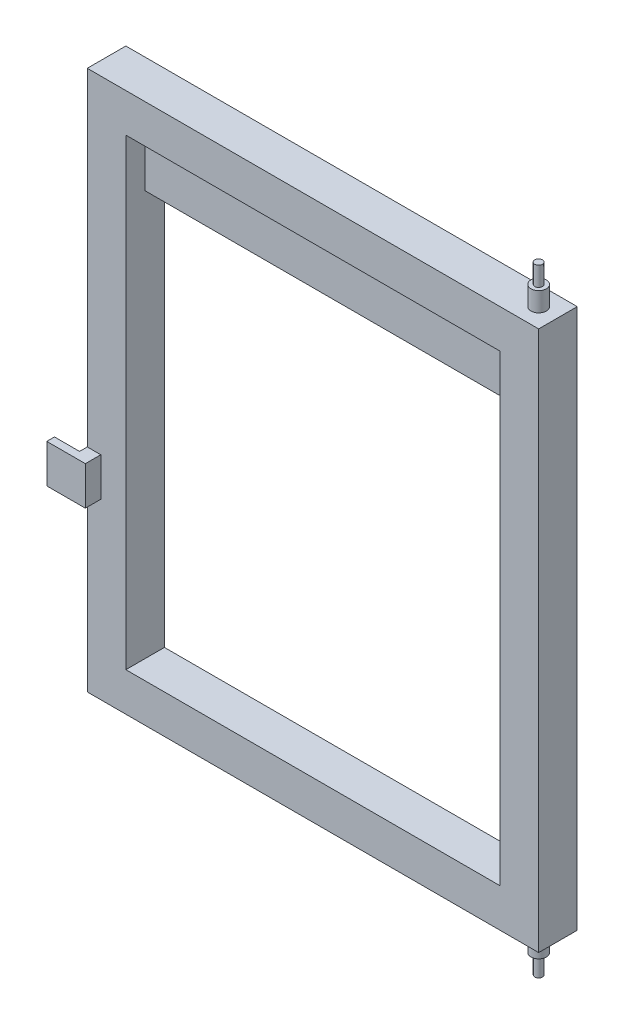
ISO-10303-21;
HEADER;
FILE_DESCRIPTION(('STEP AP214'),'2;1');
FILE_NAME('part.step','',(''),(''),'','','');
FILE_SCHEMA(('AUTOMOTIVE_DESIGN { 1 0 10303 214 1 1 1 1 }'));
ENDSEC;
DATA;
#1=APPLICATION_CONTEXT('core data for automotive mechanical design processes');
#2=APPLICATION_PROTOCOL_DEFINITION('international standard','automotive_design',2000,#1);
#3=PRODUCT_CONTEXT('',#1,'mechanical');
#4=PRODUCT('Part','Part','',(#3));
#5=PRODUCT_RELATED_PRODUCT_CATEGORY('part','',(#4));
#6=PRODUCT_DEFINITION_FORMATION('','',#4);
#7=PRODUCT_DEFINITION_CONTEXT('part definition',#1,'design');
#8=PRODUCT_DEFINITION('design','',#6,#7);
#9=PRODUCT_DEFINITION_SHAPE('','',#8);
#10=(LENGTH_UNIT() NAMED_UNIT(*) SI_UNIT(.MILLI.,.METRE.));
#11=(NAMED_UNIT(*) PLANE_ANGLE_UNIT() SI_UNIT($,.RADIAN.));
#12=(NAMED_UNIT(*) SI_UNIT($,.STERADIAN.) SOLID_ANGLE_UNIT());
#13=UNCERTAINTY_MEASURE_WITH_UNIT(LENGTH_MEASURE(1.E-05),#10,'distance_accuracy_value','');
#14=(GEOMETRIC_REPRESENTATION_CONTEXT(3) GLOBAL_UNCERTAINTY_ASSIGNED_CONTEXT((#13)) GLOBAL_UNIT_ASSIGNED_CONTEXT((#10,
#11,#12)) REPRESENTATION_CONTEXT('',''));
#15=CARTESIAN_POINT('',(0.,0.,0.));
#16=DIRECTION('',(0.,0.,1.));
#17=DIRECTION('',(1.,0.,0.));
#18=AXIS2_PLACEMENT_3D('',#15,#16,#17);
#19=CARTESIAN_POINT('',(292.5,-350.,25.));
#20=DIRECTION('',(0.,1.,0.));
#21=DIRECTION('',(-1.,0.,0.));
#22=AXIS2_PLACEMENT_3D('',#19,#20,#21);
#23=PLANE('',#22);
#24=DIRECTION('',(1.,0.,0.));
#25=VECTOR('',#24,1.);
#26=CARTESIAN_POINT('',(292.5,-350.,-25.));
#27=LINE('',#26,#25);
#28=CARTESIAN_POINT('',(-292.5,-350.,-25.));
#29=VERTEX_POINT('',#28);
#30=CARTESIAN_POINT('',(292.5,-350.,-25.));
#31=VERTEX_POINT('',#30);
#32=EDGE_CURVE('E249',#29,#31,#27,.T.);
#33=ORIENTED_EDGE('',*,*,#32,.T.);
#34=DIRECTION('',(0.,0.,-1.));
#35=VECTOR('',#34,1.);
#36=CARTESIAN_POINT('',(292.5,-350.,25.));
#37=LINE('',#36,#35);
#38=CARTESIAN_POINT('',(292.5,-350.,25.));
#39=VERTEX_POINT('',#38);
#40=EDGE_CURVE('E201',#39,#31,#37,.T.);
#41=ORIENTED_EDGE('',*,*,#40,.F.);
#42=DIRECTION('',(1.,0.,0.));
#43=VECTOR('',#42,1.);
#44=CARTESIAN_POINT('',(292.5,-350.,25.));
#45=LINE('',#44,#43);
#46=CARTESIAN_POINT('',(-292.5,-350.,25.));
#47=VERTEX_POINT('',#46);
#48=EDGE_CURVE('E216',#47,#39,#45,.T.);
#49=ORIENTED_EDGE('',*,*,#48,.F.);
#50=DIRECTION('',(0.,0.,-1.));
#51=VECTOR('',#50,1.);
#52=CARTESIAN_POINT('',(-292.5,-350.,25.));
#53=LINE('',#52,#51);
#54=EDGE_CURVE('E196',#47,#29,#53,.T.);
#55=ORIENTED_EDGE('',*,*,#54,.T.);
#56=EDGE_LOOP('',(#33,#41,#49,#55));
#57=FACE_BOUND('',#56,.T.);
#58=CARTESIAN_POINT('',(267.5,-350.,0.));
#59=DIRECTION('',(0.,1.,0.));
#60=DIRECTION('',(-1.,0.,0.));
#61=AXIS2_PLACEMENT_3D('',#58,#59,#60);
#62=CIRCLE('',#61,10.);
#63=CARTESIAN_POINT('',(257.5,-350.,0.));
#64=VERTEX_POINT('',#63);
#65=EDGE_CURVE('E11',#64,#64,#62,.F.);
#66=ORIENTED_EDGE('',*,*,#65,.F.);
#67=EDGE_LOOP('',(#66));
#68=FACE_BOUND('',#67,.T.);
#69=ADVANCED_FACE('F39',(#57,#68),#23,.F.);
#70=CARTESIAN_POINT('',(292.5,350.,25.));
#71=DIRECTION('',(0.,-1.,0.));
#72=DIRECTION('',(1.,0.,0.));
#73=AXIS2_PLACEMENT_3D('',#70,#71,#72);
#74=PLANE('',#73);
#75=DIRECTION('',(-1.,0.,0.));
#76=VECTOR('',#75,1.);
#77=CARTESIAN_POINT('',(292.5,350.,-25.));
#78=LINE('',#77,#76);
#79=CARTESIAN_POINT('',(292.5,350.,-25.));
#80=VERTEX_POINT('',#79);
#81=CARTESIAN_POINT('',(-292.5,350.,-25.));
#82=VERTEX_POINT('',#81);
#83=EDGE_CURVE('E222',#80,#82,#78,.T.);
#84=ORIENTED_EDGE('',*,*,#83,.T.);
#85=DIRECTION('',(0.,0.,-1.));
#86=VECTOR('',#85,1.);
#87=CARTESIAN_POINT('',(-292.5,350.,25.));
#88=LINE('',#87,#86);
#89=CARTESIAN_POINT('',(-292.5,350.,25.));
#90=VERTEX_POINT('',#89);
#91=EDGE_CURVE('E230',#90,#82,#88,.T.);
#92=ORIENTED_EDGE('',*,*,#91,.F.);
#93=DIRECTION('',(-1.,0.,0.));
#94=VECTOR('',#93,1.);
#95=CARTESIAN_POINT('',(292.5,350.,25.));
#96=LINE('',#95,#94);
#97=CARTESIAN_POINT('',(292.5,350.,25.));
#98=VERTEX_POINT('',#97);
#99=EDGE_CURVE('E228',#98,#90,#96,.T.);
#100=ORIENTED_EDGE('',*,*,#99,.F.);
#101=DIRECTION('',(0.,0.,-1.));
#102=VECTOR('',#101,1.);
#103=CARTESIAN_POINT('',(292.5,350.,25.));
#104=LINE('',#103,#102);
#105=EDGE_CURVE('E208',#98,#80,#104,.T.);
#106=ORIENTED_EDGE('',*,*,#105,.T.);
#107=EDGE_LOOP('',(#84,#92,#100,#106));
#108=FACE_BOUND('',#107,.T.);
#109=CARTESIAN_POINT('',(267.5,350.,0.));
#110=DIRECTION('',(0.,-1.,0.));
#111=DIRECTION('',(1.,0.,0.));
#112=AXIS2_PLACEMENT_3D('',#109,#110,#111);
#113=CIRCLE('',#112,10.);
#114=CARTESIAN_POINT('',(277.5,350.,0.));
#115=VERTEX_POINT('',#114);
#116=EDGE_CURVE('E43',#115,#115,#113,.F.);
#117=ORIENTED_EDGE('',*,*,#116,.F.);
#118=EDGE_LOOP('',(#117));
#119=FACE_BOUND('',#118,.T.);
#120=ADVANCED_FACE('F237',(#108,#119),#74,.F.);
#121=CARTESIAN_POINT('',(-292.5,350.,25.));
#122=DIRECTION('',(0.,0.,-1.));
#123=DIRECTION('',(-1.,0.,0.));
#124=AXIS2_PLACEMENT_3D('',#121,#122,#123);
#125=PLANE('',#124);
#126=DIRECTION('',(0.,1.,0.));
#127=VECTOR('',#126,1.);
#128=CARTESIAN_POINT('',(242.5,300.,25.));
#129=LINE('',#128,#127);
#130=CARTESIAN_POINT('',(242.5,-300.,25.));
#131=VERTEX_POINT('',#130);
#132=CARTESIAN_POINT('',(242.5,300.,25.));
#133=VERTEX_POINT('',#132);
#134=EDGE_CURVE('E271',#131,#133,#129,.T.);
#135=ORIENTED_EDGE('',*,*,#134,.F.);
#136=DIRECTION('',(1.,0.,0.));
#137=VECTOR('',#136,1.);
#138=CARTESIAN_POINT('',(242.5,-300.,25.));
#139=LINE('',#138,#137);
#140=CARTESIAN_POINT('',(-242.5,-300.,25.));
#141=VERTEX_POINT('',#140);
#142=EDGE_CURVE('E264',#141,#131,#139,.T.);
#143=ORIENTED_EDGE('',*,*,#142,.F.);
#144=DIRECTION('',(0.,-1.,0.));
#145=VECTOR('',#144,1.);
#146=CARTESIAN_POINT('',(-242.5,300.,25.));
#147=LINE('',#146,#145);
#148=CARTESIAN_POINT('',(-242.5,300.,25.));
#149=VERTEX_POINT('',#148);
#150=EDGE_CURVE('E266',#149,#141,#147,.T.);
#151=ORIENTED_EDGE('',*,*,#150,.F.);
#152=DIRECTION('',(-1.,0.,0.));
#153=VECTOR('',#152,1.);
#154=CARTESIAN_POINT('',(242.5,300.,25.));
#155=LINE('',#154,#153);
#156=EDGE_CURVE('E269',#133,#149,#155,.T.);
#157=ORIENTED_EDGE('',*,*,#156,.F.);
#158=EDGE_LOOP('',(#135,#143,#151,#157));
#159=FACE_BOUND('',#158,.T.);
#160=DIRECTION('',(1.,0.,0.));
#161=VECTOR('',#160,1.);
#162=CARTESIAN_POINT('',(-292.5,-125.,24.9999999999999));
#163=LINE('',#162,#161);
#164=CARTESIAN_POINT('',(-292.5,-125.,24.9999999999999));
#165=VERTEX_POINT('',#164);
#166=CARTESIAN_POINT('',(-275.,-125.,25.));
#167=VERTEX_POINT('',#166);
#168=EDGE_CURVE('E55',#165,#167,#163,.T.);
#169=ORIENTED_EDGE('',*,*,#168,.F.);
#170=DIRECTION('',(0.,-1.,0.));
#171=VECTOR('',#170,1.);
#172=CARTESIAN_POINT('',(-292.5,350.,25.));
#173=LINE('',#172,#171);
#174=EDGE_CURVE('E217',#165,#47,#173,.T.);
#175=ORIENTED_EDGE('',*,*,#174,.T.);
#176=ORIENTED_EDGE('',*,*,#48,.T.);
#177=DIRECTION('',(0.,1.,0.));
#178=VECTOR('',#177,1.);
#179=CARTESIAN_POINT('',(292.5,350.,25.));
#180=LINE('',#179,#178);
#181=EDGE_CURVE('E226',#39,#98,#180,.T.);
#182=ORIENTED_EDGE('',*,*,#181,.T.);
#183=ORIENTED_EDGE('',*,*,#99,.T.);
#184=CARTESIAN_POINT('',(-292.5,-75.,24.9999999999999));
#185=VERTEX_POINT('',#184);
#186=EDGE_CURVE('E212',#90,#185,#173,.T.);
#187=ORIENTED_EDGE('',*,*,#186,.T.);
#188=DIRECTION('',(1.,0.,0.));
#189=VECTOR('',#188,1.);
#190=CARTESIAN_POINT('',(-292.5,-75.,24.9999999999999));
#191=LINE('',#190,#189);
#192=CARTESIAN_POINT('',(-275.,-75.,25.));
#193=VERTEX_POINT('',#192);
#194=EDGE_CURVE('E165',#185,#193,#191,.T.);
#195=ORIENTED_EDGE('',*,*,#194,.T.);
#196=DIRECTION('',(0.,-1.,0.));
#197=VECTOR('',#196,1.);
#198=CARTESIAN_POINT('',(-275.,-75.,25.));
#199=LINE('',#198,#197);
#200=EDGE_CURVE('E303',#193,#167,#199,.T.);
#201=ORIENTED_EDGE('',*,*,#200,.T.);
#202=EDGE_LOOP('',(#169,#175,#176,#182,#183,#187,#195,#201));
#203=FACE_BOUND('',#202,.T.);
#204=ADVANCED_FACE('F340',(#159,#203),#125,.F.);
#205=CARTESIAN_POINT('',(-292.5,350.,-25.));
#206=DIRECTION('',(0.,0.,-1.));
#207=DIRECTION('',(-1.,0.,0.));
#208=AXIS2_PLACEMENT_3D('',#205,#206,#207);
#209=PLANE('',#208);
#210=DIRECTION('',(0.,-1.,0.));
#211=VECTOR('',#210,1.);
#212=CARTESIAN_POINT('',(-292.5,350.,-25.));
#213=LINE('',#212,#211);
#214=EDGE_CURVE('E248',#82,#29,#213,.T.);
#215=ORIENTED_EDGE('',*,*,#214,.F.);
#216=ORIENTED_EDGE('',*,*,#83,.F.);
#217=DIRECTION('',(0.,1.,0.));
#218=VECTOR('',#217,1.);
#219=CARTESIAN_POINT('',(292.5,350.,-25.));
#220=LINE('',#219,#218);
#221=EDGE_CURVE('E247',#31,#80,#220,.T.);
#222=ORIENTED_EDGE('',*,*,#221,.F.);
#223=ORIENTED_EDGE('',*,*,#32,.F.);
#224=EDGE_LOOP('',(#215,#216,#222,#223));
#225=FACE_BOUND('',#224,.T.);
#226=DIRECTION('',(1.,0.,0.));
#227=VECTOR('',#226,1.);
#228=CARTESIAN_POINT('',(242.5,-300.,-25.));
#229=LINE('',#228,#227);
#230=CARTESIAN_POINT('',(-242.5,-300.,-25.));
#231=VERTEX_POINT('',#230);
#232=CARTESIAN_POINT('',(242.5,-300.,-25.));
#233=VERTEX_POINT('',#232);
#234=EDGE_CURVE('E273',#231,#233,#229,.T.);
#235=ORIENTED_EDGE('',*,*,#234,.T.);
#236=DIRECTION('',(0.,1.,0.));
#237=VECTOR('',#236,1.);
#238=CARTESIAN_POINT('',(242.5,300.,-25.));
#239=LINE('',#238,#237);
#240=CARTESIAN_POINT('',(242.5,225.,-25.));
#241=VERTEX_POINT('',#240);
#242=EDGE_CURVE('E278',#233,#241,#239,.T.);
#243=ORIENTED_EDGE('',*,*,#242,.T.);
#244=DIRECTION('',(1.,0.,0.));
#245=VECTOR('',#244,1.);
#246=CARTESIAN_POINT('',(-242.5,225.,-25.));
#247=LINE('',#246,#245);
#248=CARTESIAN_POINT('',(-242.5,225.,-25.));
#249=VERTEX_POINT('',#248);
#250=EDGE_CURVE('E290',#249,#241,#247,.T.);
#251=ORIENTED_EDGE('',*,*,#250,.F.);
#252=DIRECTION('',(0.,-1.,0.));
#253=VECTOR('',#252,1.);
#254=CARTESIAN_POINT('',(-242.5,300.,-25.));
#255=LINE('',#254,#253);
#256=EDGE_CURVE('E276',#249,#231,#255,.T.);
#257=ORIENTED_EDGE('',*,*,#256,.T.);
#258=EDGE_LOOP('',(#235,#243,#251,#257));
#259=FACE_BOUND('',#258,.T.);
#260=ADVANCED_FACE('F245',(#225,#259),#209,.T.);
#261=CARTESIAN_POINT('',(-292.5,350.,25.));
#262=DIRECTION('',(1.,0.,0.));
#263=DIRECTION('',(0.,1.,0.));
#264=AXIS2_PLACEMENT_3D('',#261,#262,#263);
#265=PLANE('',#264);
#266=ORIENTED_EDGE('',*,*,#214,.T.);
#267=ORIENTED_EDGE('',*,*,#54,.F.);
#268=ORIENTED_EDGE('',*,*,#174,.F.);
#269=DIRECTION('',(0.,0.,-1.));
#270=VECTOR('',#269,1.);
#271=CARTESIAN_POINT('',(-292.5,-125.,24.9999999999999));
#272=LINE('',#271,#270);
#273=CARTESIAN_POINT('',(-292.5,-125.,34.9999999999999));
#274=VERTEX_POINT('',#273);
#275=EDGE_CURVE('E185',#274,#165,#272,.T.);
#276=ORIENTED_EDGE('',*,*,#275,.F.);
#277=DIRECTION('',(0.,-1.,0.));
#278=VECTOR('',#277,1.);
#279=CARTESIAN_POINT('',(-292.5,-75.,34.9999999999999));
#280=LINE('',#279,#278);
#281=CARTESIAN_POINT('',(-292.5,-75.,34.9999999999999));
#282=VERTEX_POINT('',#281);
#283=EDGE_CURVE('E308',#282,#274,#280,.T.);
#284=ORIENTED_EDGE('',*,*,#283,.F.);
#285=DIRECTION('',(0.,0.,-1.));
#286=VECTOR('',#285,1.);
#287=CARTESIAN_POINT('',(-292.5,-75.,24.9999999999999));
#288=LINE('',#287,#286);
#289=EDGE_CURVE('E314',#282,#185,#288,.T.);
#290=ORIENTED_EDGE('',*,*,#289,.T.);
#291=ORIENTED_EDGE('',*,*,#186,.F.);
#292=ORIENTED_EDGE('',*,*,#91,.T.);
#293=EDGE_LOOP('',(#266,#267,#268,#276,#284,#290,#291,#292));
#294=FACE_BOUND('',#293,.T.);
#295=ADVANCED_FACE('F41',(#294),#265,.F.);
#296=CARTESIAN_POINT('',(292.5,350.,25.));
#297=DIRECTION('',(-1.,0.,0.));
#298=DIRECTION('',(0.,-1.,0.));
#299=AXIS2_PLACEMENT_3D('',#296,#297,#298);
#300=PLANE('',#299);
#301=ORIENTED_EDGE('',*,*,#221,.T.);
#302=ORIENTED_EDGE('',*,*,#105,.F.);
#303=ORIENTED_EDGE('',*,*,#181,.F.);
#304=ORIENTED_EDGE('',*,*,#40,.T.);
#305=EDGE_LOOP('',(#301,#302,#303,#304));
#306=FACE_BOUND('',#305,.T.);
#307=ADVANCED_FACE('F342',(#306),#300,.F.);
#308=CARTESIAN_POINT('',(242.5,300.,25.));
#309=DIRECTION('',(-1.,0.,0.));
#310=DIRECTION('',(0.,-1.,0.));
#311=AXIS2_PLACEMENT_3D('',#308,#309,#310);
#312=PLANE('',#311);
#313=DIRECTION('',(0.,0.,1.));
#314=VECTOR('',#313,1.);
#315=CARTESIAN_POINT('',(242.5,225.,-25.));
#316=LINE('',#315,#314);
#317=CARTESIAN_POINT('',(242.5,225.,0.));
#318=VERTEX_POINT('',#317);
#319=EDGE_CURVE('E287',#241,#318,#316,.T.);
#320=ORIENTED_EDGE('',*,*,#319,.F.);
#321=ORIENTED_EDGE('',*,*,#242,.F.);
#322=DIRECTION('',(0.,0.,-1.));
#323=VECTOR('',#322,1.);
#324=CARTESIAN_POINT('',(242.5,-300.,25.));
#325=LINE('',#324,#323);
#326=EDGE_CURVE('E261',#131,#233,#325,.T.);
#327=ORIENTED_EDGE('',*,*,#326,.F.);
#328=ORIENTED_EDGE('',*,*,#134,.T.);
#329=DIRECTION('',(0.,0.,-1.));
#330=VECTOR('',#329,1.);
#331=CARTESIAN_POINT('',(242.5,300.,25.));
#332=LINE('',#331,#330);
#333=CARTESIAN_POINT('',(242.5,300.,0.));
#334=VERTEX_POINT('',#333);
#335=EDGE_CURVE('E253',#133,#334,#332,.T.);
#336=ORIENTED_EDGE('',*,*,#335,.T.);
#337=DIRECTION('',(0.,1.,0.));
#338=VECTOR('',#337,1.);
#339=CARTESIAN_POINT('',(242.5,300.,0.));
#340=LINE('',#339,#338);
#341=EDGE_CURVE('E63',#318,#334,#340,.T.);
#342=ORIENTED_EDGE('',*,*,#341,.F.);
#343=EDGE_LOOP('',(#320,#321,#327,#328,#336,#342));
#344=FACE_BOUND('',#343,.T.);
#345=ADVANCED_FACE('F392',(#344),#312,.T.);
#346=CARTESIAN_POINT('',(242.5,300.,25.));
#347=DIRECTION('',(0.,-1.,0.));
#348=DIRECTION('',(1.,0.,0.));
#349=AXIS2_PLACEMENT_3D('',#346,#347,#348);
#350=PLANE('',#349);
#351=DIRECTION('',(-1.,0.,0.));
#352=VECTOR('',#351,1.);
#353=CARTESIAN_POINT('',(-242.5,300.,0.));
#354=LINE('',#353,#352);
#355=CARTESIAN_POINT('',(-242.5,300.,0.));
#356=VERTEX_POINT('',#355);
#357=EDGE_CURVE('E294',#334,#356,#354,.T.);
#358=ORIENTED_EDGE('',*,*,#357,.F.);
#359=ORIENTED_EDGE('',*,*,#335,.F.);
#360=ORIENTED_EDGE('',*,*,#156,.T.);
#361=DIRECTION('',(0.,0.,-1.));
#362=VECTOR('',#361,1.);
#363=CARTESIAN_POINT('',(-242.5,300.,25.));
#364=LINE('',#363,#362);
#365=EDGE_CURVE('E255',#149,#356,#364,.T.);
#366=ORIENTED_EDGE('',*,*,#365,.T.);
#367=EDGE_LOOP('',(#358,#359,#360,#366));
#368=FACE_BOUND('',#367,.T.);
#369=ADVANCED_FACE('F397',(#368),#350,.T.);
#370=CARTESIAN_POINT('',(-242.5,300.,25.));
#371=DIRECTION('',(1.,0.,0.));
#372=DIRECTION('',(0.,1.,0.));
#373=AXIS2_PLACEMENT_3D('',#370,#371,#372);
#374=PLANE('',#373);
#375=DIRECTION('',(0.,0.,1.));
#376=VECTOR('',#375,1.);
#377=CARTESIAN_POINT('',(-242.5,225.,-25.));
#378=LINE('',#377,#376);
#379=CARTESIAN_POINT('',(-242.5,225.,0.));
#380=VERTEX_POINT('',#379);
#381=EDGE_CURVE('E288',#249,#380,#378,.T.);
#382=ORIENTED_EDGE('',*,*,#381,.T.);
#383=DIRECTION('',(0.,-1.,0.));
#384=VECTOR('',#383,1.);
#385=CARTESIAN_POINT('',(-242.5,300.,0.));
#386=LINE('',#385,#384);
#387=EDGE_CURVE('E301',#356,#380,#386,.T.);
#388=ORIENTED_EDGE('',*,*,#387,.F.);
#389=ORIENTED_EDGE('',*,*,#365,.F.);
#390=ORIENTED_EDGE('',*,*,#150,.T.);
#391=DIRECTION('',(0.,0.,-1.));
#392=VECTOR('',#391,1.);
#393=CARTESIAN_POINT('',(-242.5,-300.,25.));
#394=LINE('',#393,#392);
#395=EDGE_CURVE('E258',#141,#231,#394,.T.);
#396=ORIENTED_EDGE('',*,*,#395,.T.);
#397=ORIENTED_EDGE('',*,*,#256,.F.);
#398=EDGE_LOOP('',(#382,#388,#389,#390,#396,#397));
#399=FACE_BOUND('',#398,.T.);
#400=ADVANCED_FACE('F407',(#399),#374,.T.);
#401=CARTESIAN_POINT('',(242.5,-300.,25.));
#402=DIRECTION('',(0.,1.,0.));
#403=DIRECTION('',(-1.,0.,0.));
#404=AXIS2_PLACEMENT_3D('',#401,#402,#403);
#405=PLANE('',#404);
#406=ORIENTED_EDGE('',*,*,#234,.F.);
#407=ORIENTED_EDGE('',*,*,#395,.F.);
#408=ORIENTED_EDGE('',*,*,#142,.T.);
#409=ORIENTED_EDGE('',*,*,#326,.T.);
#410=EDGE_LOOP('',(#406,#407,#408,#409));
#411=FACE_BOUND('',#410,.T.);
#412=ADVANCED_FACE('F411',(#411),#405,.T.);
#413=CARTESIAN_POINT('',(-242.5,225.,-25.));
#414=DIRECTION('',(0.,-1.,0.));
#415=DIRECTION('',(0.,0.,-1.));
#416=AXIS2_PLACEMENT_3D('',#413,#414,#415);
#417=PLANE('',#416);
#418=DIRECTION('',(1.,0.,0.));
#419=VECTOR('',#418,1.);
#420=CARTESIAN_POINT('',(-242.5,225.,0.));
#421=LINE('',#420,#419);
#422=EDGE_CURVE('E298',#380,#318,#421,.T.);
#423=ORIENTED_EDGE('',*,*,#422,.F.);
#424=ORIENTED_EDGE('',*,*,#381,.F.);
#425=ORIENTED_EDGE('',*,*,#250,.T.);
#426=ORIENTED_EDGE('',*,*,#319,.T.);
#427=EDGE_LOOP('',(#423,#424,#425,#426));
#428=FACE_BOUND('',#427,.T.);
#429=ADVANCED_FACE('F414',(#428),#417,.T.);
#430=CARTESIAN_POINT('',(-242.5,225.,0.));
#431=DIRECTION('',(0.,0.,1.));
#432=DIRECTION('',(1.,0.,0.));
#433=AXIS2_PLACEMENT_3D('',#430,#431,#432);
#434=PLANE('',#433);
#435=ORIENTED_EDGE('',*,*,#387,.T.);
#436=ORIENTED_EDGE('',*,*,#422,.T.);
#437=ORIENTED_EDGE('',*,*,#341,.T.);
#438=ORIENTED_EDGE('',*,*,#357,.T.);
#439=EDGE_LOOP('',(#435,#436,#437,#438));
#440=FACE_BOUND('',#439,.T.);
#441=ADVANCED_FACE('F422',(#440),#434,.T.);
#442=CARTESIAN_POINT('',(-275.,-75.,25.));
#443=DIRECTION('',(1.,0.,0.));
#444=DIRECTION('',(0.,1.,0.));
#445=AXIS2_PLACEMENT_3D('',#442,#443,#444);
#446=PLANE('',#445);
#447=DIRECTION('',(0.,0.,1.));
#448=VECTOR('',#447,1.);
#449=CARTESIAN_POINT('',(-275.,-125.,25.));
#450=LINE('',#449,#448);
#451=CARTESIAN_POINT('',(-275.,-125.,45.));
#452=VERTEX_POINT('',#451);
#453=EDGE_CURVE('E157',#167,#452,#450,.T.);
#454=ORIENTED_EDGE('',*,*,#453,.F.);
#455=ORIENTED_EDGE('',*,*,#200,.F.);
#456=DIRECTION('',(0.,0.,1.));
#457=VECTOR('',#456,1.);
#458=CARTESIAN_POINT('',(-275.,-75.,25.));
#459=LINE('',#458,#457);
#460=CARTESIAN_POINT('',(-275.,-75.,45.));
#461=VERTEX_POINT('',#460);
#462=EDGE_CURVE('E160',#193,#461,#459,.T.);
#463=ORIENTED_EDGE('',*,*,#462,.T.);
#464=DIRECTION('',(0.,-1.,0.));
#465=VECTOR('',#464,1.);
#466=CARTESIAN_POINT('',(-275.,-75.,45.));
#467=LINE('',#466,#465);
#468=EDGE_CURVE('E154',#461,#452,#467,.T.);
#469=ORIENTED_EDGE('',*,*,#468,.T.);
#470=EDGE_LOOP('',(#454,#455,#463,#469));
#471=FACE_BOUND('',#470,.T.);
#472=ADVANCED_FACE('F156',(#471),#446,.T.);
#473=CARTESIAN_POINT('',(-325.,-75.0000000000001,35.));
#474=DIRECTION('',(0.,0.,-1.));
#475=DIRECTION('',(-1.,0.,0.));
#476=AXIS2_PLACEMENT_3D('',#473,#474,#475);
#477=PLANE('',#476);
#478=DIRECTION('',(1.,0.,0.));
#479=VECTOR('',#478,1.);
#480=CARTESIAN_POINT('',(-325.,-125.,35.));
#481=LINE('',#480,#479);
#482=CARTESIAN_POINT('',(-325.,-125.,35.));
#483=VERTEX_POINT('',#482);
#484=EDGE_CURVE('E182',#483,#274,#481,.T.);
#485=ORIENTED_EDGE('',*,*,#484,.F.);
#486=DIRECTION('',(0.,-1.,0.));
#487=VECTOR('',#486,1.);
#488=CARTESIAN_POINT('',(-325.,-75.0000000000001,35.));
#489=LINE('',#488,#487);
#490=CARTESIAN_POINT('',(-325.,-75.0000000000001,35.));
#491=VERTEX_POINT('',#490);
#492=EDGE_CURVE('E306',#491,#483,#489,.T.);
#493=ORIENTED_EDGE('',*,*,#492,.F.);
#494=DIRECTION('',(1.,0.,0.));
#495=VECTOR('',#494,1.);
#496=CARTESIAN_POINT('',(-325.,-75.0000000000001,35.));
#497=LINE('',#496,#495);
#498=EDGE_CURVE('E311',#491,#282,#497,.T.);
#499=ORIENTED_EDGE('',*,*,#498,.T.);
#500=ORIENTED_EDGE('',*,*,#283,.T.);
#501=EDGE_LOOP('',(#485,#493,#499,#500));
#502=FACE_BOUND('',#501,.T.);
#503=ADVANCED_FACE('F330',(#502),#477,.T.);
#504=CARTESIAN_POINT('',(-325.,-75.0000000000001,35.));
#505=DIRECTION('',(-1.,0.,0.));
#506=DIRECTION('',(0.,-1.,0.));
#507=AXIS2_PLACEMENT_3D('',#504,#505,#506);
#508=PLANE('',#507);
#509=DIRECTION('',(0.,0.,-1.));
#510=VECTOR('',#509,1.);
#511=CARTESIAN_POINT('',(-325.,-125.,35.));
#512=LINE('',#511,#510);
#513=CARTESIAN_POINT('',(-325.,-125.,45.));
#514=VERTEX_POINT('',#513);
#515=EDGE_CURVE('E172',#514,#483,#512,.T.);
#516=ORIENTED_EDGE('',*,*,#515,.F.);
#517=DIRECTION('',(0.,-1.,0.));
#518=VECTOR('',#517,1.);
#519=CARTESIAN_POINT('',(-325.,-75.0000000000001,45.));
#520=LINE('',#519,#518);
#521=CARTESIAN_POINT('',(-325.,-75.0000000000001,45.));
#522=VERTEX_POINT('',#521);
#523=EDGE_CURVE('E164',#522,#514,#520,.T.);
#524=ORIENTED_EDGE('',*,*,#523,.F.);
#525=DIRECTION('',(0.,0.,-1.));
#526=VECTOR('',#525,1.);
#527=CARTESIAN_POINT('',(-325.,-75.0000000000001,35.));
#528=LINE('',#527,#526);
#529=EDGE_CURVE('E315',#522,#491,#528,.T.);
#530=ORIENTED_EDGE('',*,*,#529,.T.);
#531=ORIENTED_EDGE('',*,*,#492,.T.);
#532=EDGE_LOOP('',(#516,#524,#530,#531));
#533=FACE_BOUND('',#532,.T.);
#534=ADVANCED_FACE('F326',(#533),#508,.T.);
#535=CARTESIAN_POINT('',(-325.,-75.0000000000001,45.));
#536=DIRECTION('',(0.,0.,1.));
#537=DIRECTION('',(1.,0.,0.));
#538=AXIS2_PLACEMENT_3D('',#535,#536,#537);
#539=PLANE('',#538);
#540=DIRECTION('',(-1.,0.,0.));
#541=VECTOR('',#540,1.);
#542=CARTESIAN_POINT('',(-325.,-125.,45.));
#543=LINE('',#542,#541);
#544=EDGE_CURVE('E168',#452,#514,#543,.T.);
#545=ORIENTED_EDGE('',*,*,#544,.F.);
#546=ORIENTED_EDGE('',*,*,#468,.F.);
#547=DIRECTION('',(-1.,0.,0.));
#548=VECTOR('',#547,1.);
#549=CARTESIAN_POINT('',(-325.,-75.0000000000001,45.));
#550=LINE('',#549,#548);
#551=EDGE_CURVE('E317',#461,#522,#550,.T.);
#552=ORIENTED_EDGE('',*,*,#551,.T.);
#553=ORIENTED_EDGE('',*,*,#523,.T.);
#554=EDGE_LOOP('',(#545,#546,#552,#553));
#555=FACE_BOUND('',#554,.T.);
#556=ADVANCED_FACE('F169',(#555),#539,.T.);
#557=CARTESIAN_POINT('',(-275.,-75.,45.));
#558=DIRECTION('',(0.,1.,0.));
#559=DIRECTION('',(-1.,0.,0.));
#560=AXIS2_PLACEMENT_3D('',#557,#558,#559);
#561=PLANE('',#560);
#562=ORIENTED_EDGE('',*,*,#462,.F.);
#563=ORIENTED_EDGE('',*,*,#194,.F.);
#564=ORIENTED_EDGE('',*,*,#289,.F.);
#565=ORIENTED_EDGE('',*,*,#498,.F.);
#566=ORIENTED_EDGE('',*,*,#529,.F.);
#567=ORIENTED_EDGE('',*,*,#551,.F.);
#568=EDGE_LOOP('',(#562,#563,#564,#565,#566,#567));
#569=FACE_BOUND('',#568,.T.);
#570=ADVANCED_FACE('F320',(#569),#561,.T.);
#571=CARTESIAN_POINT('',(-275.,-125.,45.));
#572=DIRECTION('',(0.,1.,0.));
#573=DIRECTION('',(-1.,0.,0.));
#574=AXIS2_PLACEMENT_3D('',#571,#572,#573);
#575=PLANE('',#574);
#576=ORIENTED_EDGE('',*,*,#453,.T.);
#577=ORIENTED_EDGE('',*,*,#544,.T.);
#578=ORIENTED_EDGE('',*,*,#515,.T.);
#579=ORIENTED_EDGE('',*,*,#484,.T.);
#580=ORIENTED_EDGE('',*,*,#275,.T.);
#581=ORIENTED_EDGE('',*,*,#168,.T.);
#582=EDGE_LOOP('',(#576,#577,#578,#579,#580,#581));
#583=FACE_BOUND('',#582,.T.);
#584=ADVANCED_FACE('F174',(#583),#575,.F.);
#585=CARTESIAN_POINT('',(267.5,-375.,0.));
#586=DIRECTION('',(0.,1.,0.));
#587=DIRECTION('',(0.,0.,1.));
#588=AXIS2_PLACEMENT_3D('',#585,#586,#587);
#589=PLANE('',#588);
#590=CARTESIAN_POINT('',(267.5,-375.,0.));
#591=DIRECTION('',(0.,1.,0.));
#592=DIRECTION('',(0.,0.,1.));
#593=AXIS2_PLACEMENT_3D('',#590,#591,#592);
#594=CIRCLE('',#593,10.);
#595=CARTESIAN_POINT('',(267.5,-375.,10.));
#596=VERTEX_POINT('',#595);
#597=EDGE_CURVE('E606',#596,#596,#594,.T.);
#598=ORIENTED_EDGE('',*,*,#597,.F.);
#599=EDGE_LOOP('',(#598));
#600=FACE_BOUND('',#599,.T.);
#601=CARTESIAN_POINT('',(267.5,-375.,0.));
#602=DIRECTION('',(0.,1.,0.));
#603=DIRECTION('',(0.,0.,1.));
#604=AXIS2_PLACEMENT_3D('',#601,#602,#603);
#605=CIRCLE('',#604,4.99999999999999);
#606=CARTESIAN_POINT('',(267.5,-375.,4.99999999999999));
#607=VERTEX_POINT('',#606);
#608=EDGE_CURVE('E194',#607,#607,#605,.T.);
#609=ORIENTED_EDGE('',*,*,#608,.T.);
#610=EDGE_LOOP('',(#609));
#611=FACE_BOUND('',#610,.T.);
#612=ADVANCED_FACE('F350',(#600,#611),#589,.F.);
#613=CARTESIAN_POINT('',(267.5,375.,0.));
#614=DIRECTION('',(0.,-1.,0.));
#615=DIRECTION('',(0.,0.,-1.));
#616=AXIS2_PLACEMENT_3D('',#613,#614,#615);
#617=CYLINDRICAL_SURFACE('',#616,10.);
#618=ORIENTED_EDGE('',*,*,#597,.T.);
#619=EDGE_LOOP('',(#618));
#620=FACE_BOUND('',#619,.T.);
#621=ORIENTED_EDGE('',*,*,#65,.T.);
#622=EDGE_LOOP('',(#621));
#623=FACE_BOUND('',#622,.T.);
#624=ADVANCED_FACE('F347',(#620,#623),#617,.T.);
#625=CARTESIAN_POINT('',(267.5,-400.,0.));
#626=DIRECTION('',(0.,1.,0.));
#627=DIRECTION('',(0.,0.,1.));
#628=AXIS2_PLACEMENT_3D('',#625,#626,#627);
#629=PLANE('',#628);
#630=CARTESIAN_POINT('',(267.5,-400.,0.));
#631=DIRECTION('',(0.,1.,0.));
#632=DIRECTION('',(0.,0.,1.));
#633=AXIS2_PLACEMENT_3D('',#630,#631,#632);
#634=CIRCLE('',#633,4.99999999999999);
#635=CARTESIAN_POINT('',(267.5,-400.,4.99999999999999));
#636=VERTEX_POINT('',#635);
#637=EDGE_CURVE('E284',#636,#636,#634,.T.);
#638=ORIENTED_EDGE('',*,*,#637,.F.);
#639=EDGE_LOOP('',(#638));
#640=FACE_BOUND('',#639,.T.);
#641=ADVANCED_FACE('F349',(#640),#629,.F.);
#642=CARTESIAN_POINT('',(267.5,400.,0.));
#643=DIRECTION('',(0.,-1.,0.));
#644=DIRECTION('',(0.,0.,-1.));
#645=AXIS2_PLACEMENT_3D('',#642,#643,#644);
#646=CYLINDRICAL_SURFACE('',#645,4.99999999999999);
#647=ORIENTED_EDGE('',*,*,#637,.T.);
#648=EDGE_LOOP('',(#647));
#649=FACE_BOUND('',#648,.T.);
#650=ORIENTED_EDGE('',*,*,#608,.F.);
#651=EDGE_LOOP('',(#650));
#652=FACE_BOUND('',#651,.T.);
#653=ADVANCED_FACE('F358',(#649,#652),#646,.T.);
#654=CARTESIAN_POINT('',(267.5,375.,0.));
#655=DIRECTION('',(0.,1.,0.));
#656=DIRECTION('',(0.,0.,1.));
#657=AXIS2_PLACEMENT_3D('',#654,#655,#656);
#658=CIRCLE('',#657,10.);
#659=CARTESIAN_POINT('',(267.5,375.,10.));
#660=VERTEX_POINT('',#659);
#661=EDGE_CURVE('E178',#660,#660,#658,.T.);
#662=ORIENTED_EDGE('',*,*,#661,.F.);
#663=EDGE_LOOP('',(#662));
#664=FACE_BOUND('',#663,.T.);
#665=ORIENTED_EDGE('',*,*,#116,.T.);
#666=EDGE_LOOP('',(#665));
#667=FACE_BOUND('',#666,.T.);
#668=ADVANCED_FACE('F353',(#664,#667),#617,.T.);
#669=CARTESIAN_POINT('',(267.5,375.,0.));
#670=DIRECTION('',(0.,1.,0.));
#671=DIRECTION('',(0.,0.,1.));
#672=AXIS2_PLACEMENT_3D('',#669,#670,#671);
#673=PLANE('',#672);
#674=ORIENTED_EDGE('',*,*,#661,.T.);
#675=EDGE_LOOP('',(#674));
#676=FACE_BOUND('',#675,.T.);
#677=CARTESIAN_POINT('',(267.5,375.,0.));
#678=DIRECTION('',(0.,1.,0.));
#679=DIRECTION('',(0.,0.,1.));
#680=AXIS2_PLACEMENT_3D('',#677,#678,#679);
#681=CIRCLE('',#680,4.99999999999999);
#682=CARTESIAN_POINT('',(267.5,375.,4.99999999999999));
#683=VERTEX_POINT('',#682);
#684=EDGE_CURVE('E175',#683,#683,#681,.T.);
#685=ORIENTED_EDGE('',*,*,#684,.F.);
#686=EDGE_LOOP('',(#685));
#687=FACE_BOUND('',#686,.T.);
#688=ADVANCED_FACE('F367',(#676,#687),#673,.T.);
#689=CARTESIAN_POINT('',(267.5,400.,0.));
#690=DIRECTION('',(0.,1.,0.));
#691=DIRECTION('',(0.,0.,1.));
#692=AXIS2_PLACEMENT_3D('',#689,#690,#691);
#693=PLANE('',#692);
#694=CARTESIAN_POINT('',(267.5,400.,0.));
#695=DIRECTION('',(0.,1.,0.));
#696=DIRECTION('',(0.,0.,1.));
#697=AXIS2_PLACEMENT_3D('',#694,#695,#696);
#698=CIRCLE('',#697,4.99999999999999);
#699=CARTESIAN_POINT('',(267.5,400.,4.99999999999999));
#700=VERTEX_POINT('',#699);
#701=EDGE_CURVE('E281',#700,#700,#698,.T.);
#702=ORIENTED_EDGE('',*,*,#701,.T.);
#703=EDGE_LOOP('',(#702));
#704=FACE_BOUND('',#703,.T.);
#705=ADVANCED_FACE('F373',(#704),#693,.T.);
#706=ORIENTED_EDGE('',*,*,#684,.T.);
#707=EDGE_LOOP('',(#706));
#708=FACE_BOUND('',#707,.T.);
#709=ORIENTED_EDGE('',*,*,#701,.F.);
#710=EDGE_LOOP('',(#709));
#711=FACE_BOUND('',#710,.T.);
#712=ADVANCED_FACE('F377',(#708,#711),#646,.T.);
#713=CLOSED_SHELL('',(#69,#120,#204,#260,#295,#307,#345,#369,#400,#412,#429,#441,#472,#503,#534,
#556,#570,#584,#612,#624,#641,#653,#668,#688,#705,#712));
#714=MANIFOLD_SOLID_BREP('B2',#713);
#715=ADVANCED_BREP_SHAPE_REPRESENTATION('',(#18,#714),#14);
#716=SHAPE_DEFINITION_REPRESENTATION(#9,#715);
ENDSEC;
END-ISO-10303-21;
